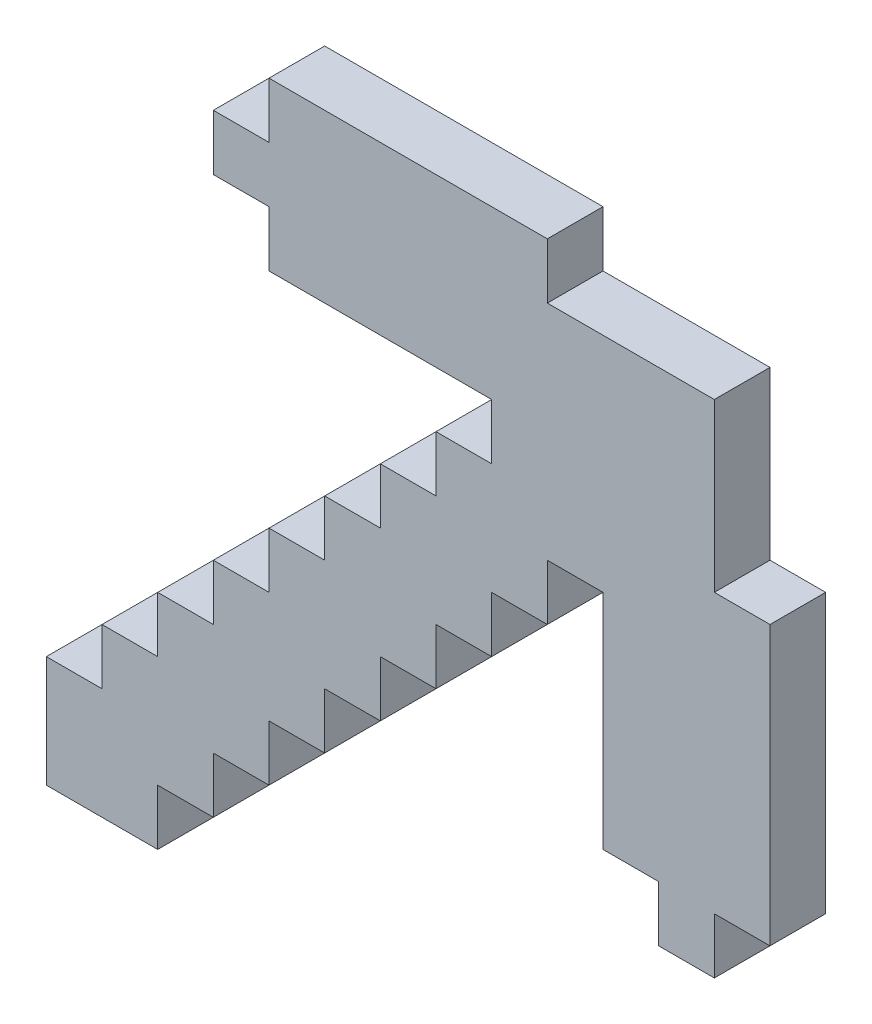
from build123d import *

# Parameters (mm, degrees)
BOSS_EXTRUDE1_DEPTH = 4.7625


with BuildPart() as part:
    # Sketch1 → Boss-Extrude1 (new body)
    with BuildSketch(Plane.XY):
        Polygon((0, 0), (9.525, 0), (9.525, 4.7625), (14.2875, 4.7625), (14.2875, 9.525), (19.05, 9.525), (19.05, 14.2875), (23.8125, 14.2875), (23.8125, 19.05), (28.575, 19.05), (28.575, 23.8125), (33.3375, 23.8125), (33.3375, 28.575), (38.1, 28.575), (38.1, 33.3375), (42.8625, 33.3375), (42.8625, 38.1), (47.625, 38.1), (47.625, 19.05), (52.3875, 19.05), (52.3875, 14.2875), (57.15, 14.2875), (57.15, 19.05), (61.9125, 19.05), (61.9125, 42.8625), (57.15, 42.8625), (57.15, 57.15), (42.8625, 57.15), (42.8625, 61.9125), (19.05, 61.9125), (19.05, 57.15), (14.2875, 57.15), (14.2875, 52.3875), (19.05, 52.3875), (19.05, 47.625), (38.1, 47.625), (38.1, 42.8625), (33.3375, 42.8625), (33.3375, 38.1), (28.575, 38.1), (28.575, 33.3375), (23.8125, 33.3375), (23.8125, 28.575), (19.05, 28.575), (19.05, 23.8125), (14.2875, 23.8125), (14.2875, 19.05), (9.525, 19.05), (9.525, 14.2875), (4.7625, 14.2875), (4.7625, 9.525), (0, 9.525), align=None)
    extrude(amount=BOSS_EXTRUDE1_DEPTH)


solid = part.part
